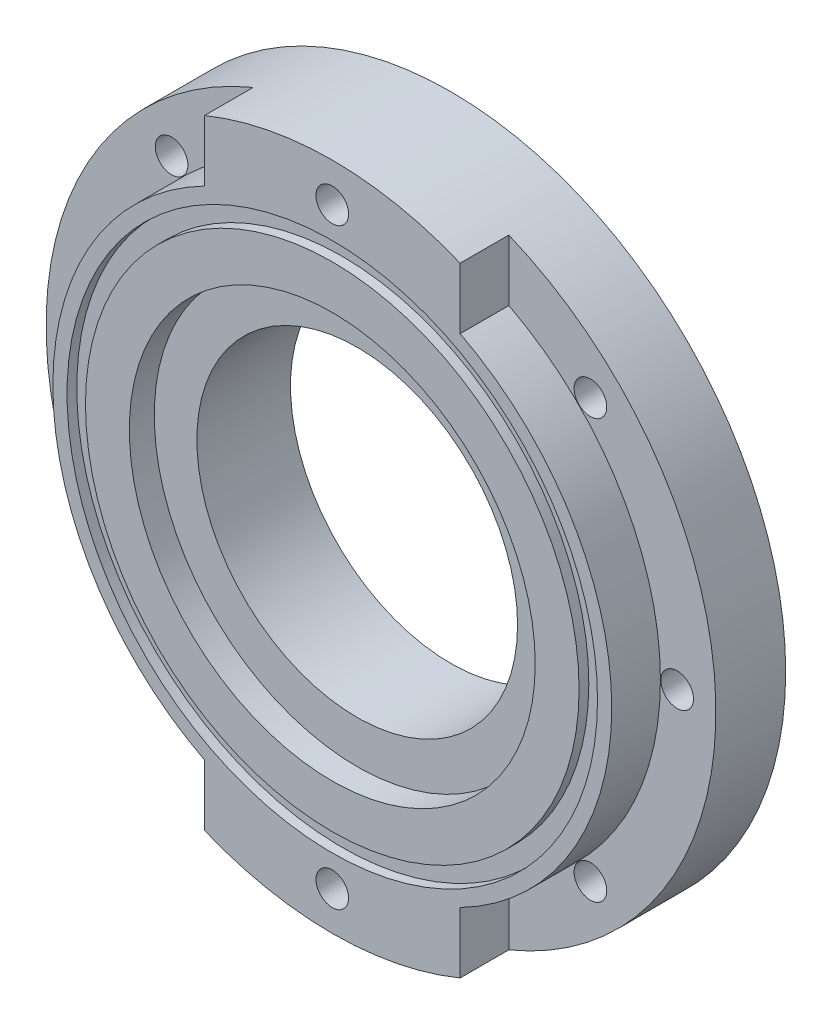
ISO-10303-21;
HEADER;
FILE_DESCRIPTION(('STEP AP214'),'2;1');
FILE_NAME('part.step','',(''),(''),'','','');
FILE_SCHEMA(('AUTOMOTIVE_DESIGN { 1 0 10303 214 1 1 1 1 }'));
ENDSEC;
DATA;
#1=APPLICATION_CONTEXT('core data for automotive mechanical design processes');
#2=APPLICATION_PROTOCOL_DEFINITION('international standard','automotive_design',2000,#1);
#3=PRODUCT_CONTEXT('',#1,'mechanical');
#4=PRODUCT('Part','Part','',(#3));
#5=PRODUCT_RELATED_PRODUCT_CATEGORY('part','',(#4));
#6=PRODUCT_DEFINITION_FORMATION('','',#4);
#7=PRODUCT_DEFINITION_CONTEXT('part definition',#1,'design');
#8=PRODUCT_DEFINITION('design','',#6,#7);
#9=PRODUCT_DEFINITION_SHAPE('','',#8);
#10=(LENGTH_UNIT() NAMED_UNIT(*) SI_UNIT(.MILLI.,.METRE.));
#11=(NAMED_UNIT(*) PLANE_ANGLE_UNIT() SI_UNIT($,.RADIAN.));
#12=(NAMED_UNIT(*) SI_UNIT($,.STERADIAN.) SOLID_ANGLE_UNIT());
#13=UNCERTAINTY_MEASURE_WITH_UNIT(LENGTH_MEASURE(1.E-05),#10,'distance_accuracy_value','');
#14=(GEOMETRIC_REPRESENTATION_CONTEXT(3) GLOBAL_UNCERTAINTY_ASSIGNED_CONTEXT((#13)) GLOBAL_UNIT_ASSIGNED_CONTEXT((#10,
#11,#12)) REPRESENTATION_CONTEXT('',''));
#15=CARTESIAN_POINT('',(0.,0.,0.));
#16=DIRECTION('',(0.,0.,1.));
#17=DIRECTION('',(1.,0.,0.));
#18=AXIS2_PLACEMENT_3D('',#15,#16,#17);
#19=CARTESIAN_POINT('',(0.,0.,18.542));
#20=DIRECTION('',(0.,0.,-1.));
#21=DIRECTION('',(-1.,0.,0.));
#22=AXIS2_PLACEMENT_3D('',#19,#20,#21);
#23=CYLINDRICAL_SURFACE('',#22,25.0825);
#24=CARTESIAN_POINT('',(0.,0.,0.));
#25=DIRECTION('',(0.,0.,1.));
#26=DIRECTION('',(1.,0.,0.));
#27=AXIS2_PLACEMENT_3D('',#24,#25,#26);
#28=CIRCLE('',#27,25.0825);
#29=CARTESIAN_POINT('',(25.0825,0.,0.));
#30=VERTEX_POINT('',#29);
#31=EDGE_CURVE('E239',#30,#30,#28,.T.);
#32=ORIENTED_EDGE('',*,*,#31,.F.);
#33=EDGE_LOOP('',(#32));
#34=FACE_BOUND('',#33,.T.);
#35=CARTESIAN_POINT('',(0.,0.,14.64056));
#36=DIRECTION('',(0.,0.,1.));
#37=DIRECTION('',(1.,0.,0.));
#38=AXIS2_PLACEMENT_3D('',#35,#36,#37);
#39=CIRCLE('',#38,25.0825);
#40=CARTESIAN_POINT('',(25.0825,0.,14.64056));
#41=VERTEX_POINT('',#40);
#42=EDGE_CURVE('E196',#41,#41,#39,.T.);
#43=ORIENTED_EDGE('',*,*,#42,.T.);
#44=EDGE_LOOP('',(#43));
#45=FACE_BOUND('',#44,.T.);
#46=ADVANCED_FACE('F33',(#34,#45),#23,.F.);
#47=CARTESIAN_POINT('',(0.,0.,18.542));
#48=DIRECTION('',(0.,0.,1.));
#49=DIRECTION('',(1.,0.,0.));
#50=AXIS2_PLACEMENT_3D('',#47,#48,#49);
#51=PLANE('',#50);
#52=CARTESIAN_POINT('',(0.,0.,18.542));
#53=DIRECTION('',(0.,0.,1.));
#54=DIRECTION('',(1.,0.,0.));
#55=AXIS2_PLACEMENT_3D('',#52,#53,#54);
#56=CIRCLE('',#55,31.75);
#57=CARTESIAN_POINT('',(31.75,0.,18.542));
#58=VERTEX_POINT('',#57);
#59=EDGE_CURVE('E192',#58,#58,#56,.T.);
#60=ORIENTED_EDGE('',*,*,#59,.F.);
#61=EDGE_LOOP('',(#60));
#62=FACE_BOUND('',#61,.T.);
#63=CARTESIAN_POINT('',(0.,0.,18.542));
#64=DIRECTION('',(0.,0.,1.));
#65=DIRECTION('',(1.,0.,0.));
#66=AXIS2_PLACEMENT_3D('',#63,#64,#65);
#67=CIRCLE('',#66,38.608);
#68=CARTESIAN_POINT('',(38.608,0.,18.542));
#69=VERTEX_POINT('',#68);
#70=EDGE_CURVE('E229',#69,#69,#67,.T.);
#71=ORIENTED_EDGE('',*,*,#70,.T.);
#72=EDGE_LOOP('',(#71));
#73=FACE_BOUND('',#72,.T.);
#74=ADVANCED_FACE('F272',(#62,#73),#51,.T.);
#75=DIRECTION('',(0.,1.,0.));
#76=VECTOR('',#75,1.);
#77=CARTESIAN_POINT('',(-20.,48.4195224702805,18.542));
#78=LINE('',#77,#76);
#79=CARTESIAN_POINT('',(-20.,38.869799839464,18.542));
#80=VERTEX_POINT('',#79);
#81=CARTESIAN_POINT('',(-20.,48.4195224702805,18.542));
#82=VERTEX_POINT('',#81);
#83=EDGE_CURVE('E143',#80,#82,#78,.T.);
#84=ORIENTED_EDGE('',*,*,#83,.F.);
#85=CARTESIAN_POINT('',(0.,0.,18.542));
#86=DIRECTION('',(0.,0.,-1.));
#87=DIRECTION('',(1.,0.,0.));
#88=AXIS2_PLACEMENT_3D('',#85,#86,#87);
#89=CIRCLE('',#88,43.7134);
#90=CARTESIAN_POINT('',(-20.,-38.869799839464,18.542));
#91=VERTEX_POINT('',#90);
#92=EDGE_CURVE('E618',#91,#80,#89,.T.);
#93=ORIENTED_EDGE('',*,*,#92,.F.);
#94=DIRECTION('',(0.,1.,0.));
#95=VECTOR('',#94,1.);
#96=CARTESIAN_POINT('',(-20.,-38.8697998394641,18.542));
#97=LINE('',#96,#95);
#98=CARTESIAN_POINT('',(-20.,-48.4195224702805,18.542));
#99=VERTEX_POINT('',#98);
#100=EDGE_CURVE('E619',#99,#91,#97,.T.);
#101=ORIENTED_EDGE('',*,*,#100,.F.);
#102=CARTESIAN_POINT('',(0.,0.,18.542));
#103=DIRECTION('',(0.,0.,1.));
#104=DIRECTION('',(1.,0.,0.));
#105=AXIS2_PLACEMENT_3D('',#102,#103,#104);
#106=CIRCLE('',#105,52.3875);
#107=CARTESIAN_POINT('',(20.,-48.4195224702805,18.542));
#108=VERTEX_POINT('',#107);
#109=EDGE_CURVE('E42',#99,#108,#106,.T.);
#110=ORIENTED_EDGE('',*,*,#109,.T.);
#111=DIRECTION('',(0.,-1.,0.));
#112=VECTOR('',#111,1.);
#113=CARTESIAN_POINT('',(20.,-38.8697998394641,18.542));
#114=LINE('',#113,#112);
#115=CARTESIAN_POINT('',(20.,-38.8697998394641,18.542));
#116=VERTEX_POINT('',#115);
#117=EDGE_CURVE('E164',#116,#108,#114,.T.);
#118=ORIENTED_EDGE('',*,*,#117,.F.);
#119=CARTESIAN_POINT('',(0.,0.,18.542));
#120=DIRECTION('',(0.,0.,-1.));
#121=DIRECTION('',(1.,0.,0.));
#122=AXIS2_PLACEMENT_3D('',#119,#120,#121);
#123=CIRCLE('',#122,43.7134);
#124=CARTESIAN_POINT('',(20.,38.8697998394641,18.542));
#125=VERTEX_POINT('',#124);
#126=EDGE_CURVE('E173',#125,#116,#123,.T.);
#127=ORIENTED_EDGE('',*,*,#126,.F.);
#128=DIRECTION('',(0.,-1.,0.));
#129=VECTOR('',#128,1.);
#130=CARTESIAN_POINT('',(20.,48.4195224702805,18.542));
#131=LINE('',#130,#129);
#132=CARTESIAN_POINT('',(20.,48.4195224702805,18.542));
#133=VERTEX_POINT('',#132);
#134=EDGE_CURVE('E160',#133,#125,#131,.T.);
#135=ORIENTED_EDGE('',*,*,#134,.F.);
#136=EDGE_CURVE('E11',#133,#82,#106,.T.);
#137=ORIENTED_EDGE('',*,*,#136,.T.);
#138=EDGE_LOOP('',(#84,#93,#101,#110,#118,#127,#135,#137));
#139=FACE_BOUND('',#138,.T.);
#140=CARTESIAN_POINT('',(0.,-46.3302466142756,18.542));
#141=DIRECTION('',(0.,0.,1.));
#142=DIRECTION('',(1.,0.,0.));
#143=AXIS2_PLACEMENT_3D('',#140,#141,#142);
#144=CIRCLE('',#143,2.55269999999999);
#145=CARTESIAN_POINT('',(2.55269999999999,-46.3302466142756,18.542));
#146=VERTEX_POINT('',#145);
#147=EDGE_CURVE('E208',#146,#146,#144,.T.);
#148=ORIENTED_EDGE('',*,*,#147,.F.);
#149=EDGE_LOOP('',(#148));
#150=FACE_BOUND('',#149,.T.);
#151=CARTESIAN_POINT('',(0.,46.3302466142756,18.542));
#152=DIRECTION('',(0.,0.,1.));
#153=DIRECTION('',(1.,0.,0.));
#154=AXIS2_PLACEMENT_3D('',#151,#152,#153);
#155=CIRCLE('',#154,2.55269999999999);
#156=CARTESIAN_POINT('',(2.55269999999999,46.3302466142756,18.542));
#157=VERTEX_POINT('',#156);
#158=EDGE_CURVE('E223',#157,#157,#155,.T.);
#159=ORIENTED_EDGE('',*,*,#158,.F.);
#160=EDGE_LOOP('',(#159));
#161=FACE_BOUND('',#160,.T.);
#162=CARTESIAN_POINT('',(0.,0.,18.542));
#163=DIRECTION('',(0.,0.,1.));
#164=DIRECTION('',(1.,0.,0.));
#165=AXIS2_PLACEMENT_3D('',#162,#163,#164);
#166=CIRCLE('',#165,41.4909);
#167=CARTESIAN_POINT('',(41.4909,0.,18.542));
#168=VERTEX_POINT('',#167);
#169=EDGE_CURVE('E233',#168,#168,#166,.T.);
#170=ORIENTED_EDGE('',*,*,#169,.F.);
#171=EDGE_LOOP('',(#170));
#172=FACE_BOUND('',#171,.T.);
#173=ADVANCED_FACE('F278',(#139,#150,#161,#172),#51,.T.);
#174=CARTESIAN_POINT('',(0.,0.,0.));
#175=DIRECTION('',(0.,0.,1.));
#176=DIRECTION('',(1.,0.,0.));
#177=AXIS2_PLACEMENT_3D('',#174,#175,#176);
#178=PLANE('',#177);
#179=CARTESIAN_POINT('',(0.,0.,0.));
#180=DIRECTION('',(0.,0.,1.));
#181=DIRECTION('',(1.,0.,0.));
#182=AXIS2_PLACEMENT_3D('',#179,#180,#181);
#183=CIRCLE('',#182,52.3875);
#184=CARTESIAN_POINT('',(52.3875,0.,0.));
#185=VERTEX_POINT('',#184);
#186=EDGE_CURVE('E243',#185,#185,#183,.T.);
#187=ORIENTED_EDGE('',*,*,#186,.F.);
#188=EDGE_LOOP('',(#187));
#189=FACE_BOUND('',#188,.T.);
#190=ORIENTED_EDGE('',*,*,#31,.T.);
#191=EDGE_LOOP('',(#190));
#192=FACE_BOUND('',#191,.T.);
#193=ADVANCED_FACE('F287',(#189,#192),#178,.F.);
#194=CARTESIAN_POINT('',(0.,0.,18.542));
#195=DIRECTION('',(0.,0.,-1.));
#196=DIRECTION('',(-1.,0.,0.));
#197=AXIS2_PLACEMENT_3D('',#194,#195,#196);
#198=CYLINDRICAL_SURFACE('',#197,52.3875);
#199=CARTESIAN_POINT('',(0.,0.,10.922));
#200=DIRECTION('',(0.,0.,1.));
#201=DIRECTION('',(1.,0.,0.));
#202=AXIS2_PLACEMENT_3D('',#199,#200,#201);
#203=CIRCLE('',#202,52.3875);
#204=CARTESIAN_POINT('',(-20.,48.4195224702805,10.922));
#205=VERTEX_POINT('',#204);
#206=CARTESIAN_POINT('',(-20.,-48.4195224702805,10.922));
#207=VERTEX_POINT('',#206);
#208=EDGE_CURVE('E136',#205,#207,#203,.T.);
#209=ORIENTED_EDGE('',*,*,#208,.F.);
#210=DIRECTION('',(0.,0.,1.));
#211=VECTOR('',#210,1.);
#212=CARTESIAN_POINT('',(-20.,48.4195224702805,10.922));
#213=LINE('',#212,#211);
#214=EDGE_CURVE('E624',#205,#82,#213,.T.);
#215=ORIENTED_EDGE('',*,*,#214,.T.);
#216=ORIENTED_EDGE('',*,*,#136,.F.);
#217=DIRECTION('',(0.,0.,1.));
#218=VECTOR('',#217,1.);
#219=CARTESIAN_POINT('',(20.,48.4195224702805,10.922));
#220=LINE('',#219,#218);
#221=CARTESIAN_POINT('',(20.,48.4195224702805,10.922));
#222=VERTEX_POINT('',#221);
#223=EDGE_CURVE('E170',#222,#133,#220,.T.);
#224=ORIENTED_EDGE('',*,*,#223,.F.);
#225=CARTESIAN_POINT('',(0.,0.,10.922));
#226=DIRECTION('',(0.,0.,1.));
#227=DIRECTION('',(1.,0.,0.));
#228=AXIS2_PLACEMENT_3D('',#225,#226,#227);
#229=CIRCLE('',#228,52.3875);
#230=CARTESIAN_POINT('',(20.,-48.4195224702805,10.922));
#231=VERTEX_POINT('',#230);
#232=EDGE_CURVE('E161',#231,#222,#229,.T.);
#233=ORIENTED_EDGE('',*,*,#232,.F.);
#234=DIRECTION('',(0.,0.,1.));
#235=VECTOR('',#234,1.);
#236=CARTESIAN_POINT('',(20.,-48.4195224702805,10.922));
#237=LINE('',#236,#235);
#238=EDGE_CURVE('E178',#231,#108,#237,.T.);
#239=ORIENTED_EDGE('',*,*,#238,.T.);
#240=ORIENTED_EDGE('',*,*,#109,.F.);
#241=DIRECTION('',(0.,0.,1.));
#242=VECTOR('',#241,1.);
#243=CARTESIAN_POINT('',(-20.,-48.4195224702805,10.922));
#244=LINE('',#243,#242);
#245=EDGE_CURVE('E131',#207,#99,#244,.T.);
#246=ORIENTED_EDGE('',*,*,#245,.F.);
#247=EDGE_LOOP('',(#209,#215,#216,#224,#233,#239,#240,#246));
#248=FACE_BOUND('',#247,.T.);
#249=ORIENTED_EDGE('',*,*,#186,.T.);
#250=EDGE_LOOP('',(#249));
#251=FACE_BOUND('',#250,.T.);
#252=ADVANCED_FACE('F35',(#248,#251),#198,.T.);
#253=CARTESIAN_POINT('',(0.,0.,17.02054));
#254=DIRECTION('',(0.,0.,1.));
#255=DIRECTION('',(1.,0.,0.));
#256=AXIS2_PLACEMENT_3D('',#253,#254,#255);
#257=CYLINDRICAL_SURFACE('',#256,41.4909);
#258=CARTESIAN_POINT('',(0.,0.,17.02054));
#259=DIRECTION('',(0.,0.,1.));
#260=DIRECTION('',(1.,0.,0.));
#261=AXIS2_PLACEMENT_3D('',#258,#259,#260);
#262=CIRCLE('',#261,41.4909);
#263=CARTESIAN_POINT('',(41.4909,0.,17.02054));
#264=VERTEX_POINT('',#263);
#265=EDGE_CURVE('E236',#264,#264,#262,.T.);
#266=CARTESIAN_POINT('',(41.4909,0.,17.02054));
#267=CARTESIAN_POINT('',(41.4909,0.,17.0363885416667));
#268=CARTESIAN_POINT('',(41.4909,0.,17.0522370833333));
#269=CARTESIAN_POINT('',(41.4909,0.,17.0839341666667));
#270=CARTESIAN_POINT('',(41.4909,0.,17.0997827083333));
#271=CARTESIAN_POINT('',(41.4909,0.,17.1314797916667));
#272=CARTESIAN_POINT('',(41.4909,0.,17.1473283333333));
#273=CARTESIAN_POINT('',(41.4909,0.,17.1790254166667));
#274=CARTESIAN_POINT('',(41.4909,0.,17.1948739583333));
#275=CARTESIAN_POINT('',(41.4909,0.,17.2265710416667));
#276=CARTESIAN_POINT('',(41.4909,0.,17.2424195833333));
#277=CARTESIAN_POINT('',(41.4909,0.,17.2741166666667));
#278=CARTESIAN_POINT('',(41.4909,0.,17.2899652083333));
#279=CARTESIAN_POINT('',(41.4909,0.,17.3216622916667));
#280=CARTESIAN_POINT('',(41.4909,0.,17.3375108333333));
#281=CARTESIAN_POINT('',(41.4909,0.,17.3692079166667));
#282=CARTESIAN_POINT('',(41.4909,0.,17.3850564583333));
#283=CARTESIAN_POINT('',(41.4909,0.,17.4167535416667));
#284=CARTESIAN_POINT('',(41.4909,0.,17.4326020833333));
#285=CARTESIAN_POINT('',(41.4909,0.,17.4642991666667));
#286=CARTESIAN_POINT('',(41.4909,0.,17.4801477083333));
#287=CARTESIAN_POINT('',(41.4909,0.,17.5118447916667));
#288=CARTESIAN_POINT('',(41.4909,0.,17.5276933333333));
#289=CARTESIAN_POINT('',(41.4909,0.,17.5593904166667));
#290=CARTESIAN_POINT('',(41.4909,0.,17.5752389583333));
#291=CARTESIAN_POINT('',(41.4909,0.,17.6069360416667));
#292=CARTESIAN_POINT('',(41.4909,0.,17.6227845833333));
#293=CARTESIAN_POINT('',(41.4909,0.,17.6544816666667));
#294=CARTESIAN_POINT('',(41.4909,0.,17.6703302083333));
#295=CARTESIAN_POINT('',(41.4909,0.,17.7020272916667));
#296=CARTESIAN_POINT('',(41.4909,0.,17.7178758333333));
#297=CARTESIAN_POINT('',(41.4909,0.,17.7495729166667));
#298=CARTESIAN_POINT('',(41.4909,0.,17.7654214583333));
#299=CARTESIAN_POINT('',(41.4909,0.,17.7971185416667));
#300=CARTESIAN_POINT('',(41.4909,0.,17.8129670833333));
#301=CARTESIAN_POINT('',(41.4909,0.,17.8446641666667));
#302=CARTESIAN_POINT('',(41.4909,0.,17.8605127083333));
#303=CARTESIAN_POINT('',(41.4909,0.,17.8922097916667));
#304=CARTESIAN_POINT('',(41.4909,0.,17.9080583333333));
#305=CARTESIAN_POINT('',(41.4909,0.,17.9397554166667));
#306=CARTESIAN_POINT('',(41.4909,0.,17.9556039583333));
#307=CARTESIAN_POINT('',(41.4909,0.,17.9873010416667));
#308=CARTESIAN_POINT('',(41.4909,0.,18.0031495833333));
#309=CARTESIAN_POINT('',(41.4909,0.,18.0348466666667));
#310=CARTESIAN_POINT('',(41.4909,0.,18.0506952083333));
#311=CARTESIAN_POINT('',(41.4909,0.,18.0823922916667));
#312=CARTESIAN_POINT('',(41.4909,0.,18.0982408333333));
#313=CARTESIAN_POINT('',(41.4909,0.,18.1299379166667));
#314=CARTESIAN_POINT('',(41.4909,0.,18.1457864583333));
#315=CARTESIAN_POINT('',(41.4909,0.,18.1774835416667));
#316=CARTESIAN_POINT('',(41.4909,0.,18.1933320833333));
#317=CARTESIAN_POINT('',(41.4909,0.,18.2250291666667));
#318=CARTESIAN_POINT('',(41.4909,0.,18.2408777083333));
#319=CARTESIAN_POINT('',(41.4909,0.,18.2725747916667));
#320=CARTESIAN_POINT('',(41.4909,0.,18.2884233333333));
#321=CARTESIAN_POINT('',(41.4909,0.,18.3201204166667));
#322=CARTESIAN_POINT('',(41.4909,0.,18.3359689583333));
#323=CARTESIAN_POINT('',(41.4909,0.,18.3676660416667));
#324=CARTESIAN_POINT('',(41.4909,0.,18.3835145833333));
#325=CARTESIAN_POINT('',(41.4909,0.,18.4152116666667));
#326=CARTESIAN_POINT('',(41.4909,0.,18.4310602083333));
#327=CARTESIAN_POINT('',(41.4909,0.,18.4627572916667));
#328=CARTESIAN_POINT('',(41.4909,0.,18.4786058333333));
#329=CARTESIAN_POINT('',(41.4909,0.,18.5103029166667));
#330=CARTESIAN_POINT('',(41.4909,0.,18.5261514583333));
#331=CARTESIAN_POINT('',(41.4909,0.,18.542));
#332=B_SPLINE_CURVE_WITH_KNOTS('',3,(#266,#267,#268,#269,#270,#271,#272,#273,#274,#275,#276,
#277,#278,#279,#280,#281,#282,#283,#284,#285,#286,#287,#288,#289,#290,#291,#292,#293,#294,#295,
#296,#297,#298,#299,#300,#301,#302,#303,#304,#305,#306,#307,#308,#309,#310,#311,#312,#313,#314,
#315,#316,#317,#318,#319,#320,#321,#322,#323,#324,#325,#326,#327,#328,#329,#330,#331),
.UNSPECIFIED.,.F.,.F.,(4,2,2,2,2,2,2,2,2,2,2,2,2,2,2,2,2,2,2,2,2,2,2,2,2,2,2,2,2,2,2,2,4),(0.,
0.0475456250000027,0.0950912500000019,0.142636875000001,0.1901825,0.237728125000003,
0.285273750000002,0.332819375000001,0.380365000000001,0.427910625,0.475456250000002,
0.523001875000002,0.570547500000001,0.618093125,0.665638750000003,0.713184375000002,
0.760730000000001,0.808275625,0.85582125,0.903366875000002,0.950912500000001,0.998458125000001,
1.04600375,1.093549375,1.141095,1.188640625,1.23618625,1.283731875,1.3312775,1.378823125,
1.42636875,1.473914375,1.52146),.UNSPECIFIED.);
#333=EDGE_CURVE('BSEAM284',#264,#168,#332,.T.);
#334=ORIENTED_EDGE('',*,*,#265,.F.);
#335=ORIENTED_EDGE('',*,*,#169,.T.);
#336=ORIENTED_EDGE('',*,*,#333,.T.);
#337=ORIENTED_EDGE('',*,*,#333,.F.);
#338=EDGE_LOOP('',(#334,#336,#335,#337));
#339=FACE_BOUND('',#338,.T.);
#340=ADVANCED_FACE('F284',(#339),#257,.F.);
#341=CARTESIAN_POINT('',(0.,0.,17.02054));
#342=DIRECTION('',(0.,0.,1.));
#343=DIRECTION('',(1.,0.,0.));
#344=AXIS2_PLACEMENT_3D('',#341,#342,#343);
#345=PLANE('',#344);
#346=CARTESIAN_POINT('',(0.,0.,17.02054));
#347=DIRECTION('',(0.,0.,1.));
#348=DIRECTION('',(1.,0.,0.));
#349=AXIS2_PLACEMENT_3D('',#346,#347,#348);
#350=CIRCLE('',#349,38.608);
#351=CARTESIAN_POINT('',(38.608,0.,17.02054));
#352=VERTEX_POINT('',#351);
#353=EDGE_CURVE('E230',#352,#352,#350,.T.);
#354=ORIENTED_EDGE('',*,*,#353,.F.);
#355=EDGE_LOOP('',(#354));
#356=FACE_BOUND('',#355,.T.);
#357=ORIENTED_EDGE('',*,*,#265,.T.);
#358=EDGE_LOOP('',(#357));
#359=FACE_BOUND('',#358,.T.);
#360=ADVANCED_FACE('F299',(#356,#359),#345,.T.);
#361=CARTESIAN_POINT('',(0.,0.,17.02054));
#362=DIRECTION('',(0.,0.,1.));
#363=DIRECTION('',(1.,0.,0.));
#364=AXIS2_PLACEMENT_3D('',#361,#362,#363);
#365=CYLINDRICAL_SURFACE('',#364,38.608);
#366=CARTESIAN_POINT('',(38.608,0.,17.02054));
#367=CARTESIAN_POINT('',(38.608,0.,17.0363885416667));
#368=CARTESIAN_POINT('',(38.608,0.,17.0522370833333));
#369=CARTESIAN_POINT('',(38.608,0.,17.0839341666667));
#370=CARTESIAN_POINT('',(38.608,0.,17.0997827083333));
#371=CARTESIAN_POINT('',(38.608,0.,17.1314797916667));
#372=CARTESIAN_POINT('',(38.608,0.,17.1473283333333));
#373=CARTESIAN_POINT('',(38.608,0.,17.1790254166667));
#374=CARTESIAN_POINT('',(38.608,0.,17.1948739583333));
#375=CARTESIAN_POINT('',(38.608,0.,17.2265710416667));
#376=CARTESIAN_POINT('',(38.608,0.,17.2424195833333));
#377=CARTESIAN_POINT('',(38.608,0.,17.2741166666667));
#378=CARTESIAN_POINT('',(38.608,0.,17.2899652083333));
#379=CARTESIAN_POINT('',(38.608,0.,17.3216622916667));
#380=CARTESIAN_POINT('',(38.608,0.,17.3375108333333));
#381=CARTESIAN_POINT('',(38.608,0.,17.3692079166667));
#382=CARTESIAN_POINT('',(38.608,0.,17.3850564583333));
#383=CARTESIAN_POINT('',(38.608,0.,17.4167535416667));
#384=CARTESIAN_POINT('',(38.608,0.,17.4326020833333));
#385=CARTESIAN_POINT('',(38.608,0.,17.4642991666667));
#386=CARTESIAN_POINT('',(38.608,0.,17.4801477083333));
#387=CARTESIAN_POINT('',(38.608,0.,17.5118447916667));
#388=CARTESIAN_POINT('',(38.608,0.,17.5276933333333));
#389=CARTESIAN_POINT('',(38.608,0.,17.5593904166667));
#390=CARTESIAN_POINT('',(38.608,0.,17.5752389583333));
#391=CARTESIAN_POINT('',(38.608,0.,17.6069360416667));
#392=CARTESIAN_POINT('',(38.608,0.,17.6227845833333));
#393=CARTESIAN_POINT('',(38.608,0.,17.6544816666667));
#394=CARTESIAN_POINT('',(38.608,0.,17.6703302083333));
#395=CARTESIAN_POINT('',(38.608,0.,17.7020272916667));
#396=CARTESIAN_POINT('',(38.608,0.,17.7178758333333));
#397=CARTESIAN_POINT('',(38.608,0.,17.7495729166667));
#398=CARTESIAN_POINT('',(38.608,0.,17.7654214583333));
#399=CARTESIAN_POINT('',(38.608,0.,17.7971185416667));
#400=CARTESIAN_POINT('',(38.608,0.,17.8129670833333));
#401=CARTESIAN_POINT('',(38.608,0.,17.8446641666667));
#402=CARTESIAN_POINT('',(38.608,0.,17.8605127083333));
#403=CARTESIAN_POINT('',(38.608,0.,17.8922097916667));
#404=CARTESIAN_POINT('',(38.608,0.,17.9080583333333));
#405=CARTESIAN_POINT('',(38.608,0.,17.9397554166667));
#406=CARTESIAN_POINT('',(38.608,0.,17.9556039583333));
#407=CARTESIAN_POINT('',(38.608,0.,17.9873010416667));
#408=CARTESIAN_POINT('',(38.608,0.,18.0031495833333));
#409=CARTESIAN_POINT('',(38.608,0.,18.0348466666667));
#410=CARTESIAN_POINT('',(38.608,0.,18.0506952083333));
#411=CARTESIAN_POINT('',(38.608,0.,18.0823922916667));
#412=CARTESIAN_POINT('',(38.608,0.,18.0982408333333));
#413=CARTESIAN_POINT('',(38.608,0.,18.1299379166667));
#414=CARTESIAN_POINT('',(38.608,0.,18.1457864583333));
#415=CARTESIAN_POINT('',(38.608,0.,18.1774835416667));
#416=CARTESIAN_POINT('',(38.608,0.,18.1933320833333));
#417=CARTESIAN_POINT('',(38.608,0.,18.2250291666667));
#418=CARTESIAN_POINT('',(38.608,0.,18.2408777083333));
#419=CARTESIAN_POINT('',(38.608,0.,18.2725747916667));
#420=CARTESIAN_POINT('',(38.608,0.,18.2884233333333));
#421=CARTESIAN_POINT('',(38.608,0.,18.3201204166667));
#422=CARTESIAN_POINT('',(38.608,0.,18.3359689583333));
#423=CARTESIAN_POINT('',(38.608,0.,18.3676660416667));
#424=CARTESIAN_POINT('',(38.608,0.,18.3835145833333));
#425=CARTESIAN_POINT('',(38.608,0.,18.4152116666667));
#426=CARTESIAN_POINT('',(38.608,0.,18.4310602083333));
#427=CARTESIAN_POINT('',(38.608,0.,18.4627572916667));
#428=CARTESIAN_POINT('',(38.608,0.,18.4786058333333));
#429=CARTESIAN_POINT('',(38.608,0.,18.5103029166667));
#430=CARTESIAN_POINT('',(38.608,0.,18.5261514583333));
#431=CARTESIAN_POINT('',(38.608,0.,18.542));
#432=B_SPLINE_CURVE_WITH_KNOTS('',3,(#366,#367,#368,#369,#370,#371,#372,#373,#374,#375,#376,
#377,#378,#379,#380,#381,#382,#383,#384,#385,#386,#387,#388,#389,#390,#391,#392,#393,#394,#395,
#396,#397,#398,#399,#400,#401,#402,#403,#404,#405,#406,#407,#408,#409,#410,#411,#412,#413,#414,
#415,#416,#417,#418,#419,#420,#421,#422,#423,#424,#425,#426,#427,#428,#429,#430,#431),
.UNSPECIFIED.,.F.,.F.,(4,2,2,2,2,2,2,2,2,2,2,2,2,2,2,2,2,2,2,2,2,2,2,2,2,2,2,2,2,2,2,2,4),(0.,
0.0475456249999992,0.0950912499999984,0.142636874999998,0.190182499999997,0.237728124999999,
0.285273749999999,0.332819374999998,0.380364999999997,0.427910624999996,0.475456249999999,
0.523001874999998,0.570547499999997,0.618093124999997,0.665638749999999,0.713184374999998,
0.760729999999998,0.808275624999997,0.855821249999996,0.903366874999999,0.950912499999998,
0.998458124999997,1.04600375,1.093549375,1.141095,1.188640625,1.23618625,1.283731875,1.3312775,
1.378823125,1.42636875,1.473914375,1.52146),.UNSPECIFIED.);
#433=EDGE_CURVE('BSEAM304',#352,#69,#432,.T.);
#434=ORIENTED_EDGE('',*,*,#353,.T.);
#435=ORIENTED_EDGE('',*,*,#70,.F.);
#436=ORIENTED_EDGE('',*,*,#433,.T.);
#437=ORIENTED_EDGE('',*,*,#433,.F.);
#438=EDGE_LOOP('',(#434,#436,#435,#437));
#439=FACE_BOUND('',#438,.T.);
#440=ADVANCED_FACE('F304',(#439),#365,.T.);
#441=CARTESIAN_POINT('',(0.,46.3302466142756,4.572));
#442=DIRECTION('',(0.,0.,1.));
#443=DIRECTION('',(1.,0.,0.));
#444=AXIS2_PLACEMENT_3D('',#441,#442,#443);
#445=CONICAL_SURFACE('',#444,2.5527,1.02974425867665);
#446=CARTESIAN_POINT('',(0.,46.3302466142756,3.03818309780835));
#447=VERTEX_POINT('',#446);
#448=VERTEX_LOOP('',#447);
#449=FACE_BOUND('',#448,.T.);
#450=CARTESIAN_POINT('',(0.,46.3302466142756,4.572));
#451=DIRECTION('',(0.,0.,1.));
#452=DIRECTION('',(1.,0.,0.));
#453=AXIS2_PLACEMENT_3D('',#450,#451,#452);
#454=CIRCLE('',#453,2.5527);
#455=CARTESIAN_POINT('',(2.5527,46.3302466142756,4.572));
#456=VERTEX_POINT('',#455);
#457=EDGE_CURVE('E226',#456,#456,#454,.T.);
#458=ORIENTED_EDGE('',*,*,#457,.T.);
#459=EDGE_LOOP('',(#458));
#460=FACE_BOUND('',#459,.T.);
#461=ADVANCED_FACE('F314',(#449,#460),#445,.F.);
#462=CARTESIAN_POINT('',(0.,46.3302466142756,18.542));
#463=DIRECTION('',(0.,0.,1.));
#464=DIRECTION('',(1.,0.,0.));
#465=AXIS2_PLACEMENT_3D('',#462,#463,#464);
#466=CYLINDRICAL_SURFACE('',#465,2.55269999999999);
#467=ORIENTED_EDGE('',*,*,#457,.F.);
#468=EDGE_LOOP('',(#467));
#469=FACE_BOUND('',#468,.T.);
#470=ORIENTED_EDGE('',*,*,#158,.T.);
#471=EDGE_LOOP('',(#470));
#472=FACE_BOUND('',#471,.T.);
#473=ADVANCED_FACE('F321',(#469,#472),#466,.F.);
#474=CARTESIAN_POINT('',(0.,-46.3302466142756,4.572));
#475=DIRECTION('',(0.,0.,1.));
#476=DIRECTION('',(1.,0.,0.));
#477=AXIS2_PLACEMENT_3D('',#474,#475,#476);
#478=CONICAL_SURFACE('',#477,2.5527,1.02974425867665);
#479=CARTESIAN_POINT('',(0.,-46.3302466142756,3.03818309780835));
#480=VERTEX_POINT('',#479);
#481=VERTEX_LOOP('',#480);
#482=FACE_BOUND('',#481,.T.);
#483=CARTESIAN_POINT('',(0.,-46.3302466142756,4.572));
#484=DIRECTION('',(0.,0.,1.));
#485=DIRECTION('',(1.,0.,0.));
#486=AXIS2_PLACEMENT_3D('',#483,#484,#485);
#487=CIRCLE('',#486,2.5527);
#488=CARTESIAN_POINT('',(2.5527,-46.3302466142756,4.572));
#489=VERTEX_POINT('',#488);
#490=EDGE_CURVE('E211',#489,#489,#487,.T.);
#491=ORIENTED_EDGE('',*,*,#490,.T.);
#492=EDGE_LOOP('',(#491));
#493=FACE_BOUND('',#492,.T.);
#494=ADVANCED_FACE('F325',(#482,#493),#478,.F.);
#495=CARTESIAN_POINT('',(0.,-46.3302466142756,18.542));
#496=DIRECTION('',(0.,0.,1.));
#497=DIRECTION('',(1.,0.,0.));
#498=AXIS2_PLACEMENT_3D('',#495,#496,#497);
#499=CYLINDRICAL_SURFACE('',#498,2.55269999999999);
#500=ORIENTED_EDGE('',*,*,#490,.F.);
#501=EDGE_LOOP('',(#500));
#502=FACE_BOUND('',#501,.T.);
#503=ORIENTED_EDGE('',*,*,#147,.T.);
#504=EDGE_LOOP('',(#503));
#505=FACE_BOUND('',#504,.T.);
#506=ADVANCED_FACE('F353',(#502,#505),#499,.F.);
#507=CARTESIAN_POINT('',(0.,0.,14.64056));
#508=DIRECTION('',(0.,0.,1.));
#509=DIRECTION('',(1.,0.,0.));
#510=AXIS2_PLACEMENT_3D('',#507,#508,#509);
#511=CYLINDRICAL_SURFACE('',#510,31.75);
#512=CARTESIAN_POINT('',(0.,0.,14.64056));
#513=DIRECTION('',(0.,0.,1.));
#514=DIRECTION('',(1.,0.,0.));
#515=AXIS2_PLACEMENT_3D('',#512,#513,#514);
#516=CIRCLE('',#515,31.75);
#517=CARTESIAN_POINT('',(31.75,0.,14.64056));
#518=VERTEX_POINT('',#517);
#519=EDGE_CURVE('E193',#518,#518,#516,.T.);
#520=ORIENTED_EDGE('',*,*,#519,.F.);
#521=EDGE_LOOP('',(#520));
#522=FACE_BOUND('',#521,.T.);
#523=ORIENTED_EDGE('',*,*,#59,.T.);
#524=EDGE_LOOP('',(#523));
#525=FACE_BOUND('',#524,.T.);
#526=ADVANCED_FACE('F357',(#522,#525),#511,.F.);
#527=CARTESIAN_POINT('',(0.,0.,14.64056));
#528=DIRECTION('',(0.,0.,1.));
#529=DIRECTION('',(1.,0.,0.));
#530=AXIS2_PLACEMENT_3D('',#527,#528,#529);
#531=PLANE('',#530);
#532=ORIENTED_EDGE('',*,*,#42,.F.);
#533=EDGE_LOOP('',(#532));
#534=FACE_BOUND('',#533,.T.);
#535=ORIENTED_EDGE('',*,*,#519,.T.);
#536=EDGE_LOOP('',(#535));
#537=FACE_BOUND('',#536,.T.);
#538=ADVANCED_FACE('F382',(#534,#537),#531,.T.);
#539=CARTESIAN_POINT('',(0.,0.,10.922));
#540=DIRECTION('',(0.,0.,1.));
#541=DIRECTION('',(1.,0.,0.));
#542=AXIS2_PLACEMENT_3D('',#539,#540,#541);
#543=PLANE('',#542);
#544=CARTESIAN_POINT('',(46.3302466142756,4.85283574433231E-13,10.922));
#545=DIRECTION('',(0.,0.,1.));
#546=DIRECTION('',(1.,0.,0.));
#547=AXIS2_PLACEMENT_3D('',#544,#545,#546);
#548=CIRCLE('',#547,2.55269999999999);
#549=CARTESIAN_POINT('',(48.8829466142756,4.85283574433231E-13,10.922));
#550=VERTEX_POINT('',#549);
#551=EDGE_CURVE('E186',#550,#550,#548,.F.);
#552=ORIENTED_EDGE('',*,*,#551,.T.);
#553=EDGE_LOOP('',(#552));
#554=FACE_BOUND('',#553,.T.);
#555=ORIENTED_EDGE('',*,*,#232,.T.);
#556=DIRECTION('',(0.,-1.,0.));
#557=VECTOR('',#556,1.);
#558=CARTESIAN_POINT('',(20.,48.4195224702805,10.922));
#559=LINE('',#558,#557);
#560=CARTESIAN_POINT('',(20.,38.8697998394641,10.922));
#561=VERTEX_POINT('',#560);
#562=EDGE_CURVE('E163',#222,#561,#559,.T.);
#563=ORIENTED_EDGE('',*,*,#562,.T.);
#564=CARTESIAN_POINT('',(0.,0.,10.922));
#565=DIRECTION('',(0.,0.,-1.));
#566=DIRECTION('',(1.,0.,0.));
#567=AXIS2_PLACEMENT_3D('',#564,#565,#566);
#568=CIRCLE('',#567,43.7134);
#569=CARTESIAN_POINT('',(20.,-38.8697998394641,10.922));
#570=VERTEX_POINT('',#569);
#571=EDGE_CURVE('E167',#561,#570,#568,.T.);
#572=ORIENTED_EDGE('',*,*,#571,.T.);
#573=DIRECTION('',(0.,-1.,0.));
#574=VECTOR('',#573,1.);
#575=CARTESIAN_POINT('',(20.,-38.8697998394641,10.922));
#576=LINE('',#575,#574);
#577=EDGE_CURVE('E58',#570,#231,#576,.T.);
#578=ORIENTED_EDGE('',*,*,#577,.T.);
#579=EDGE_LOOP('',(#555,#563,#572,#578));
#580=FACE_BOUND('',#579,.T.);
#581=CARTESIAN_POINT('',(32.760431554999,32.7604315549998,10.922));
#582=DIRECTION('',(0.,0.,1.));
#583=DIRECTION('',(1.,0.,0.));
#584=AXIS2_PLACEMENT_3D('',#581,#582,#583);
#585=CIRCLE('',#584,2.55269999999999);
#586=CARTESIAN_POINT('',(35.313131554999,32.7604315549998,10.922));
#587=VERTEX_POINT('',#586);
#588=EDGE_CURVE('E180',#587,#587,#585,.F.);
#589=ORIENTED_EDGE('',*,*,#588,.T.);
#590=EDGE_LOOP('',(#589));
#591=FACE_BOUND('',#590,.T.);
#592=CARTESIAN_POINT('',(32.7604315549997,-32.7604315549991,10.922));
#593=DIRECTION('',(0.,0.,1.));
#594=DIRECTION('',(1.,0.,0.));
#595=AXIS2_PLACEMENT_3D('',#592,#593,#594);
#596=CIRCLE('',#595,2.55269999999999);
#597=CARTESIAN_POINT('',(35.3131315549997,-32.7604315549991,10.922));
#598=VERTEX_POINT('',#597);
#599=EDGE_CURVE('E189',#598,#598,#596,.F.);
#600=ORIENTED_EDGE('',*,*,#599,.T.);
#601=EDGE_LOOP('',(#600));
#602=FACE_BOUND('',#601,.T.);
#603=ADVANCED_FACE('F251',(#554,#580,#591,#602),#543,.T.);
#604=CARTESIAN_POINT('',(20.,-38.8697998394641,10.922));
#605=DIRECTION('',(-1.,0.,0.));
#606=DIRECTION('',(0.,-1.,0.));
#607=AXIS2_PLACEMENT_3D('',#604,#605,#606);
#608=PLANE('',#607);
#609=ORIENTED_EDGE('',*,*,#117,.T.);
#610=ORIENTED_EDGE('',*,*,#238,.F.);
#611=ORIENTED_EDGE('',*,*,#577,.F.);
#612=DIRECTION('',(0.,0.,1.));
#613=VECTOR('',#612,1.);
#614=CARTESIAN_POINT('',(20.,-38.8697998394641,10.922));
#615=LINE('',#614,#613);
#616=EDGE_CURVE('E181',#570,#116,#615,.T.);
#617=ORIENTED_EDGE('',*,*,#616,.T.);
#618=EDGE_LOOP('',(#609,#610,#611,#617));
#619=FACE_BOUND('',#618,.T.);
#620=ADVANCED_FACE('F381',(#619),#608,.F.);
#621=CARTESIAN_POINT('',(0.,0.,10.922));
#622=DIRECTION('',(0.,0.,1.));
#623=DIRECTION('',(1.,0.,0.));
#624=AXIS2_PLACEMENT_3D('',#621,#622,#623);
#625=CYLINDRICAL_SURFACE('',#624,43.7134);
#626=ORIENTED_EDGE('',*,*,#126,.T.);
#627=ORIENTED_EDGE('',*,*,#616,.F.);
#628=ORIENTED_EDGE('',*,*,#571,.F.);
#629=DIRECTION('',(0.,0.,1.));
#630=VECTOR('',#629,1.);
#631=CARTESIAN_POINT('',(20.,38.8697998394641,10.922));
#632=LINE('',#631,#630);
#633=EDGE_CURVE('E183',#561,#125,#632,.T.);
#634=ORIENTED_EDGE('',*,*,#633,.T.);
#635=EDGE_LOOP('',(#626,#627,#628,#634));
#636=FACE_BOUND('',#635,.T.);
#637=ADVANCED_FACE('F394',(#636),#625,.T.);
#638=CARTESIAN_POINT('',(20.,48.4195224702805,10.922));
#639=DIRECTION('',(-1.,0.,0.));
#640=DIRECTION('',(0.,-1.,0.));
#641=AXIS2_PLACEMENT_3D('',#638,#639,#640);
#642=PLANE('',#641);
#643=ORIENTED_EDGE('',*,*,#134,.T.);
#644=ORIENTED_EDGE('',*,*,#633,.F.);
#645=ORIENTED_EDGE('',*,*,#562,.F.);
#646=ORIENTED_EDGE('',*,*,#223,.T.);
#647=EDGE_LOOP('',(#643,#644,#645,#646));
#648=FACE_BOUND('',#647,.T.);
#649=ADVANCED_FACE('F370',(#648),#642,.F.);
#650=CARTESIAN_POINT('',(46.3302466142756,4.85283574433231E-13,4.572));
#651=DIRECTION('',(0.,0.,1.));
#652=DIRECTION('',(1.,0.,0.));
#653=AXIS2_PLACEMENT_3D('',#650,#651,#652);
#654=CONICAL_SURFACE('',#653,2.5527,1.02974425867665);
#655=CARTESIAN_POINT('',(46.3302466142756,4.85283574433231E-13,3.03818309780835));
#656=VERTEX_POINT('',#655);
#657=VERTEX_LOOP('',#656);
#658=FACE_BOUND('',#657,.T.);
#659=CARTESIAN_POINT('',(46.3302466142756,4.85283574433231E-13,4.572));
#660=DIRECTION('',(0.,0.,1.));
#661=DIRECTION('',(1.,0.,0.));
#662=AXIS2_PLACEMENT_3D('',#659,#660,#661);
#663=CIRCLE('',#662,2.5527);
#664=CARTESIAN_POINT('',(48.8829466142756,4.85283574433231E-13,4.572));
#665=VERTEX_POINT('',#664);
#666=EDGE_CURVE('E202',#665,#665,#663,.T.);
#667=ORIENTED_EDGE('',*,*,#666,.T.);
#668=EDGE_LOOP('',(#667));
#669=FACE_BOUND('',#668,.T.);
#670=ADVANCED_FACE('F367',(#658,#669),#654,.F.);
#671=CARTESIAN_POINT('',(46.3302466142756,4.85283574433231E-13,18.542));
#672=DIRECTION('',(0.,0.,1.));
#673=DIRECTION('',(1.,0.,0.));
#674=AXIS2_PLACEMENT_3D('',#671,#672,#673);
#675=CYLINDRICAL_SURFACE('',#674,2.55269999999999);
#676=ORIENTED_EDGE('',*,*,#666,.F.);
#677=EDGE_LOOP('',(#676));
#678=FACE_BOUND('',#677,.T.);
#679=ORIENTED_EDGE('',*,*,#551,.F.);
#680=EDGE_LOOP('',(#679));
#681=FACE_BOUND('',#680,.T.);
#682=ADVANCED_FACE('F362',(#678,#681),#675,.F.);
#683=CARTESIAN_POINT('',(32.7604315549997,-32.7604315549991,4.572));
#684=DIRECTION('',(0.,0.,1.));
#685=DIRECTION('',(1.,0.,0.));
#686=AXIS2_PLACEMENT_3D('',#683,#684,#685);
#687=CONICAL_SURFACE('',#686,2.5527,1.02974425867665);
#688=CARTESIAN_POINT('',(32.7604315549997,-32.7604315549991,3.03818309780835));
#689=VERTEX_POINT('',#688);
#690=VERTEX_LOOP('',#689);
#691=FACE_BOUND('',#690,.T.);
#692=CARTESIAN_POINT('',(32.7604315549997,-32.7604315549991,4.572));
#693=DIRECTION('',(0.,0.,1.));
#694=DIRECTION('',(1.,0.,0.));
#695=AXIS2_PLACEMENT_3D('',#692,#693,#694);
#696=CIRCLE('',#695,2.5527);
#697=CARTESIAN_POINT('',(35.3131315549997,-32.7604315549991,4.572));
#698=VERTEX_POINT('',#697);
#699=EDGE_CURVE('E205',#698,#698,#696,.T.);
#700=ORIENTED_EDGE('',*,*,#699,.T.);
#701=EDGE_LOOP('',(#700));
#702=FACE_BOUND('',#701,.T.);
#703=ADVANCED_FACE('F359',(#691,#702),#687,.F.);
#704=CARTESIAN_POINT('',(32.7604315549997,-32.7604315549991,18.542));
#705=DIRECTION('',(0.,0.,1.));
#706=DIRECTION('',(1.,0.,0.));
#707=AXIS2_PLACEMENT_3D('',#704,#705,#706);
#708=CYLINDRICAL_SURFACE('',#707,2.55269999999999);
#709=ORIENTED_EDGE('',*,*,#699,.F.);
#710=EDGE_LOOP('',(#709));
#711=FACE_BOUND('',#710,.T.);
#712=ORIENTED_EDGE('',*,*,#599,.F.);
#713=EDGE_LOOP('',(#712));
#714=FACE_BOUND('',#713,.T.);
#715=ADVANCED_FACE('F266',(#711,#714),#708,.F.);
#716=CARTESIAN_POINT('',(32.760431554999,32.7604315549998,4.572));
#717=DIRECTION('',(0.,0.,1.));
#718=DIRECTION('',(1.,0.,0.));
#719=AXIS2_PLACEMENT_3D('',#716,#717,#718);
#720=CONICAL_SURFACE('',#719,2.5527,1.02974425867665);
#721=CARTESIAN_POINT('',(32.760431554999,32.7604315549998,3.03818309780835));
#722=VERTEX_POINT('',#721);
#723=VERTEX_LOOP('',#722);
#724=FACE_BOUND('',#723,.T.);
#725=CARTESIAN_POINT('',(32.760431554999,32.7604315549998,4.572));
#726=DIRECTION('',(0.,0.,1.));
#727=DIRECTION('',(1.,0.,0.));
#728=AXIS2_PLACEMENT_3D('',#725,#726,#727);
#729=CIRCLE('',#728,2.5527);
#730=CARTESIAN_POINT('',(35.313131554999,32.7604315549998,4.572));
#731=VERTEX_POINT('',#730);
#732=EDGE_CURVE('E199',#731,#731,#729,.T.);
#733=ORIENTED_EDGE('',*,*,#732,.T.);
#734=EDGE_LOOP('',(#733));
#735=FACE_BOUND('',#734,.T.);
#736=ADVANCED_FACE('F256',(#724,#735),#720,.F.);
#737=CARTESIAN_POINT('',(32.760431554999,32.7604315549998,18.542));
#738=DIRECTION('',(0.,0.,1.));
#739=DIRECTION('',(1.,0.,0.));
#740=AXIS2_PLACEMENT_3D('',#737,#738,#739);
#741=CYLINDRICAL_SURFACE('',#740,2.55269999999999);
#742=ORIENTED_EDGE('',*,*,#732,.F.);
#743=EDGE_LOOP('',(#742));
#744=FACE_BOUND('',#743,.T.);
#745=ORIENTED_EDGE('',*,*,#588,.F.);
#746=EDGE_LOOP('',(#745));
#747=FACE_BOUND('',#746,.T.);
#748=ADVANCED_FACE('F254',(#744,#747),#741,.F.);
#749=CARTESIAN_POINT('',(0.,0.,10.922));
#750=DIRECTION('',(0.,0.,1.));
#751=DIRECTION('',(1.,0.,0.));
#752=AXIS2_PLACEMENT_3D('',#749,#750,#751);
#753=PLANE('',#752);
#754=CARTESIAN_POINT('',(-46.3302466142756,-1.61761191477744E-13,10.922));
#755=DIRECTION('',(0.,0.,1.));
#756=DIRECTION('',(1.,0.,0.));
#757=AXIS2_PLACEMENT_3D('',#754,#755,#756);
#758=CIRCLE('',#757,2.55269999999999);
#759=CARTESIAN_POINT('',(-43.7775466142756,-1.61761191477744E-13,10.922));
#760=VERTEX_POINT('',#759);
#761=EDGE_CURVE('E154',#760,#760,#758,.F.);
#762=ORIENTED_EDGE('',*,*,#761,.T.);
#763=EDGE_LOOP('',(#762));
#764=FACE_BOUND('',#763,.T.);
#765=ORIENTED_EDGE('',*,*,#208,.T.);
#766=DIRECTION('',(0.,1.,0.));
#767=VECTOR('',#766,1.);
#768=CARTESIAN_POINT('',(-20.,-38.8697998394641,10.922));
#769=LINE('',#768,#767);
#770=CARTESIAN_POINT('',(-20.,-38.869799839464,10.922));
#771=VERTEX_POINT('',#770);
#772=EDGE_CURVE('E127',#207,#771,#769,.T.);
#773=ORIENTED_EDGE('',*,*,#772,.T.);
#774=CARTESIAN_POINT('',(0.,0.,10.922));
#775=DIRECTION('',(0.,0.,-1.));
#776=DIRECTION('',(1.,0.,0.));
#777=AXIS2_PLACEMENT_3D('',#774,#775,#776);
#778=CIRCLE('',#777,43.7134);
#779=CARTESIAN_POINT('',(-20.,38.869799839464,10.922));
#780=VERTEX_POINT('',#779);
#781=EDGE_CURVE('E135',#771,#780,#778,.T.);
#782=ORIENTED_EDGE('',*,*,#781,.T.);
#783=DIRECTION('',(0.,1.,0.));
#784=VECTOR('',#783,1.);
#785=CARTESIAN_POINT('',(-20.,48.4195224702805,10.922));
#786=LINE('',#785,#784);
#787=EDGE_CURVE('E50',#780,#205,#786,.T.);
#788=ORIENTED_EDGE('',*,*,#787,.T.);
#789=EDGE_LOOP('',(#765,#773,#782,#788));
#790=FACE_BOUND('',#789,.T.);
#791=CARTESIAN_POINT('',(-32.7604315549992,-32.7604315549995,10.922));
#792=DIRECTION('',(0.,0.,1.));
#793=DIRECTION('',(1.,0.,0.));
#794=AXIS2_PLACEMENT_3D('',#791,#792,#793);
#795=CIRCLE('',#794,2.55269999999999);
#796=CARTESIAN_POINT('',(-30.2077315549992,-32.7604315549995,10.922));
#797=VERTEX_POINT('',#796);
#798=EDGE_CURVE('E37',#797,#797,#795,.F.);
#799=ORIENTED_EDGE('',*,*,#798,.T.);
#800=EDGE_LOOP('',(#799));
#801=FACE_BOUND('',#800,.T.);
#802=CARTESIAN_POINT('',(-32.7604315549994,32.7604315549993,10.922));
#803=DIRECTION('',(0.,0.,1.));
#804=DIRECTION('',(1.,0.,0.));
#805=AXIS2_PLACEMENT_3D('',#802,#803,#804);
#806=CIRCLE('',#805,2.55269999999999);
#807=CARTESIAN_POINT('',(-30.2077315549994,32.7604315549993,10.922));
#808=VERTEX_POINT('',#807);
#809=EDGE_CURVE('E157',#808,#808,#806,.F.);
#810=ORIENTED_EDGE('',*,*,#809,.T.);
#811=EDGE_LOOP('',(#810));
#812=FACE_BOUND('',#811,.T.);
#813=ADVANCED_FACE('F139',(#764,#790,#801,#812),#753,.T.);
#814=CARTESIAN_POINT('',(-20.,48.4195224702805,10.922));
#815=DIRECTION('',(1.,0.,0.));
#816=DIRECTION('',(0.,1.,0.));
#817=AXIS2_PLACEMENT_3D('',#814,#815,#816);
#818=PLANE('',#817);
#819=ORIENTED_EDGE('',*,*,#83,.T.);
#820=ORIENTED_EDGE('',*,*,#214,.F.);
#821=ORIENTED_EDGE('',*,*,#787,.F.);
#822=DIRECTION('',(0.,0.,1.));
#823=VECTOR('',#822,1.);
#824=CARTESIAN_POINT('',(-20.,38.869799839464,10.922));
#825=LINE('',#824,#823);
#826=EDGE_CURVE('E149',#780,#80,#825,.T.);
#827=ORIENTED_EDGE('',*,*,#826,.T.);
#828=EDGE_LOOP('',(#819,#820,#821,#827));
#829=FACE_BOUND('',#828,.T.);
#830=ADVANCED_FACE('F263',(#829),#818,.F.);
#831=CARTESIAN_POINT('',(0.,0.,10.922));
#832=DIRECTION('',(0.,0.,1.));
#833=DIRECTION('',(1.,0.,0.));
#834=AXIS2_PLACEMENT_3D('',#831,#832,#833);
#835=CYLINDRICAL_SURFACE('',#834,43.7134);
#836=ORIENTED_EDGE('',*,*,#92,.T.);
#837=ORIENTED_EDGE('',*,*,#826,.F.);
#838=ORIENTED_EDGE('',*,*,#781,.F.);
#839=DIRECTION('',(0.,0.,1.));
#840=VECTOR('',#839,1.);
#841=CARTESIAN_POINT('',(-20.,-38.869799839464,10.922));
#842=LINE('',#841,#840);
#843=EDGE_CURVE('E133',#771,#91,#842,.T.);
#844=ORIENTED_EDGE('',*,*,#843,.T.);
#845=EDGE_LOOP('',(#836,#837,#838,#844));
#846=FACE_BOUND('',#845,.T.);
#847=ADVANCED_FACE('F481',(#846),#835,.T.);
#848=CARTESIAN_POINT('',(-20.,-38.8697998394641,10.922));
#849=DIRECTION('',(1.,0.,0.));
#850=DIRECTION('',(0.,1.,0.));
#851=AXIS2_PLACEMENT_3D('',#848,#849,#850);
#852=PLANE('',#851);
#853=ORIENTED_EDGE('',*,*,#100,.T.);
#854=ORIENTED_EDGE('',*,*,#843,.F.);
#855=ORIENTED_EDGE('',*,*,#772,.F.);
#856=ORIENTED_EDGE('',*,*,#245,.T.);
#857=EDGE_LOOP('',(#853,#854,#855,#856));
#858=FACE_BOUND('',#857,.T.);
#859=ADVANCED_FACE('F129',(#858),#852,.F.);
#860=CARTESIAN_POINT('',(-46.3302466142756,-1.61761191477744E-13,4.572));
#861=DIRECTION('',(0.,0.,1.));
#862=DIRECTION('',(1.,0.,0.));
#863=AXIS2_PLACEMENT_3D('',#860,#861,#862);
#864=CONICAL_SURFACE('',#863,2.5527,1.02974425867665);
#865=CARTESIAN_POINT('',(-46.3302466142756,-1.61761191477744E-13,3.03818309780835));
#866=VERTEX_POINT('',#865);
#867=VERTEX_LOOP('',#866);
#868=FACE_BOUND('',#867,.T.);
#869=CARTESIAN_POINT('',(-46.3302466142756,-1.61761191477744E-13,4.572));
#870=DIRECTION('',(0.,0.,1.));
#871=DIRECTION('',(1.,0.,0.));
#872=AXIS2_PLACEMENT_3D('',#869,#870,#871);
#873=CIRCLE('',#872,2.5527);
#874=CARTESIAN_POINT('',(-43.7775466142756,-1.61761191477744E-13,4.572));
#875=VERTEX_POINT('',#874);
#876=EDGE_CURVE('E217',#875,#875,#873,.T.);
#877=ORIENTED_EDGE('',*,*,#876,.T.);
#878=EDGE_LOOP('',(#877));
#879=FACE_BOUND('',#878,.T.);
#880=ADVANCED_FACE('F337',(#868,#879),#864,.F.);
#881=CARTESIAN_POINT('',(-46.3302466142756,-1.61761191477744E-13,18.542));
#882=DIRECTION('',(0.,0.,1.));
#883=DIRECTION('',(1.,0.,0.));
#884=AXIS2_PLACEMENT_3D('',#881,#882,#883);
#885=CYLINDRICAL_SURFACE('',#884,2.55269999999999);
#886=ORIENTED_EDGE('',*,*,#876,.F.);
#887=EDGE_LOOP('',(#886));
#888=FACE_BOUND('',#887,.T.);
#889=ORIENTED_EDGE('',*,*,#761,.F.);
#890=EDGE_LOOP('',(#889));
#891=FACE_BOUND('',#890,.T.);
#892=ADVANCED_FACE('F331',(#888,#891),#885,.F.);
#893=CARTESIAN_POINT('',(-32.7604315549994,32.7604315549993,4.572));
#894=DIRECTION('',(0.,0.,1.));
#895=DIRECTION('',(1.,0.,0.));
#896=AXIS2_PLACEMENT_3D('',#893,#894,#895);
#897=CONICAL_SURFACE('',#896,2.5527,1.02974425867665);
#898=CARTESIAN_POINT('',(-32.7604315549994,32.7604315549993,3.03818309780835));
#899=VERTEX_POINT('',#898);
#900=VERTEX_LOOP('',#899);
#901=FACE_BOUND('',#900,.T.);
#902=CARTESIAN_POINT('',(-32.7604315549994,32.7604315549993,4.572));
#903=DIRECTION('',(0.,0.,1.));
#904=DIRECTION('',(1.,0.,0.));
#905=AXIS2_PLACEMENT_3D('',#902,#903,#904);
#906=CIRCLE('',#905,2.5527);
#907=CARTESIAN_POINT('',(-30.2077315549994,32.7604315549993,4.572));
#908=VERTEX_POINT('',#907);
#909=EDGE_CURVE('E220',#908,#908,#906,.T.);
#910=ORIENTED_EDGE('',*,*,#909,.T.);
#911=EDGE_LOOP('',(#910));
#912=FACE_BOUND('',#911,.T.);
#913=ADVANCED_FACE('F327',(#901,#912),#897,.F.);
#914=CARTESIAN_POINT('',(-32.7604315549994,32.7604315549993,18.542));
#915=DIRECTION('',(0.,0.,1.));
#916=DIRECTION('',(1.,0.,0.));
#917=AXIS2_PLACEMENT_3D('',#914,#915,#916);
#918=CYLINDRICAL_SURFACE('',#917,2.55269999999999);
#919=ORIENTED_EDGE('',*,*,#909,.F.);
#920=EDGE_LOOP('',(#919));
#921=FACE_BOUND('',#920,.T.);
#922=ORIENTED_EDGE('',*,*,#809,.F.);
#923=EDGE_LOOP('',(#922));
#924=FACE_BOUND('',#923,.T.);
#925=ADVANCED_FACE('F330',(#921,#924),#918,.F.);
#926=CARTESIAN_POINT('',(-32.7604315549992,-32.7604315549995,4.572));
#927=DIRECTION('',(0.,0.,1.));
#928=DIRECTION('',(1.,0.,0.));
#929=AXIS2_PLACEMENT_3D('',#926,#927,#928);
#930=CONICAL_SURFACE('',#929,2.5527,1.02974425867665);
#931=CARTESIAN_POINT('',(-32.7604315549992,-32.7604315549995,3.03818309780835));
#932=VERTEX_POINT('',#931);
#933=VERTEX_LOOP('',#932);
#934=FACE_BOUND('',#933,.T.);
#935=CARTESIAN_POINT('',(-32.7604315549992,-32.7604315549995,4.572));
#936=DIRECTION('',(0.,0.,1.));
#937=DIRECTION('',(1.,0.,0.));
#938=AXIS2_PLACEMENT_3D('',#935,#936,#937);
#939=CIRCLE('',#938,2.5527);
#940=CARTESIAN_POINT('',(-30.2077315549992,-32.7604315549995,4.572));
#941=VERTEX_POINT('',#940);
#942=EDGE_CURVE('E214',#941,#941,#939,.T.);
#943=ORIENTED_EDGE('',*,*,#942,.T.);
#944=EDGE_LOOP('',(#943));
#945=FACE_BOUND('',#944,.T.);
#946=ADVANCED_FACE('F335',(#934,#945),#930,.F.);
#947=CARTESIAN_POINT('',(-32.7604315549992,-32.7604315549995,18.542));
#948=DIRECTION('',(0.,0.,1.));
#949=DIRECTION('',(1.,0.,0.));
#950=AXIS2_PLACEMENT_3D('',#947,#948,#949);
#951=CYLINDRICAL_SURFACE('',#950,2.55269999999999);
#952=ORIENTED_EDGE('',*,*,#942,.F.);
#953=EDGE_LOOP('',(#952));
#954=FACE_BOUND('',#953,.T.);
#955=ORIENTED_EDGE('',*,*,#798,.F.);
#956=EDGE_LOOP('',(#955));
#957=FACE_BOUND('',#956,.T.);
#958=ADVANCED_FACE('F346',(#954,#957),#951,.F.);
#959=CLOSED_SHELL('',(#46,#74,#173,#193,#252,#340,#360,#440,#461,#473,#494,#506,#526,#538,#603,
#620,#637,#649,#670,#682,#703,#715,#736,#748,#813,#830,#847,#859,#880,#892,#913,#925,#946,#958));
#960=MANIFOLD_SOLID_BREP('B2',#959);
#961=ADVANCED_BREP_SHAPE_REPRESENTATION('',(#18,#960),#14);
#962=SHAPE_DEFINITION_REPRESENTATION(#9,#961);
ENDSEC;
END-ISO-10303-21;
